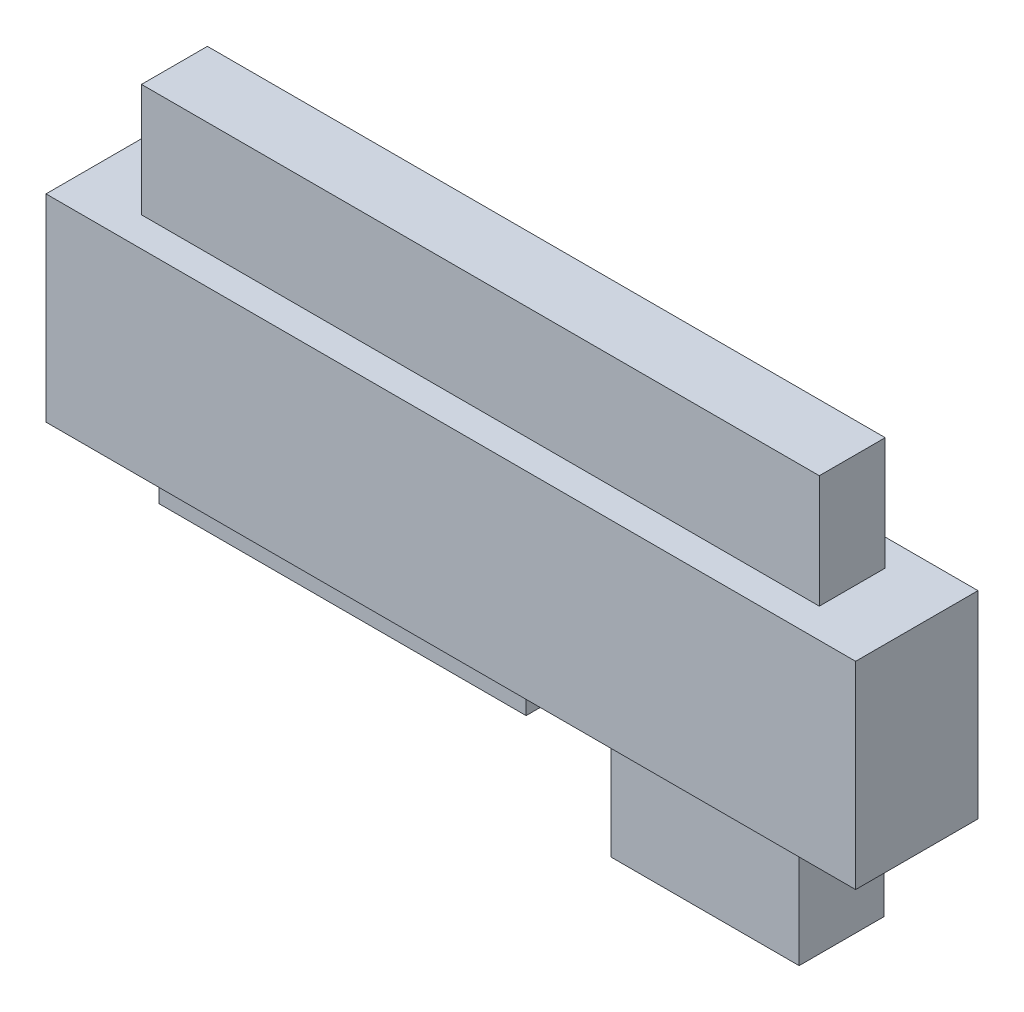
from build123d import *

# Parameters (mm, degrees)
SKETCH1_W           = 43
SKETCH1_H           = 6.5
BOSS_EXTRUDE1_DEPTH = 10.5
SKETCH2_W           = 36
SKETCH2_H           = 3.5
BOSS_EXTRUDE3_DEPTH = 6
SKETCH3_W           = 10
SKETCH3_H           = 4.5
BOSS_EXTRUDE4_DEPTH = 6
SKETCH4_W           = 19.5
SKETCH4_H           = 4
BOSS_EXTRUDE5_DEPTH = 2


with BuildPart() as part:
    # Sketch1 → Boss-Extrude1 (new body)
    with BuildSketch(Plane(origin=(0, 0, 0), x_dir=(1, 0, 0), z_dir=(0, 1, 0))):
        Rectangle(SKETCH1_W, SKETCH1_H)
    extrude(amount=BOSS_EXTRUDE1_DEPTH)

    # Sketch2 → Boss-Extrude3 (add)
    with BuildSketch(Plane(origin=(0, 10.5, 0), x_dir=(1, 0, 0), z_dir=(0, 1, 0))):
        with Locations((0, 0.072111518)):
            Rectangle(SKETCH2_W, SKETCH2_H)
    extrude(amount=BOSS_EXTRUDE3_DEPTH)

    # Sketch3 → Boss-Extrude4 (add)
    with BuildSketch(Plane.XZ):
        with Locations((12.5, 0)):
            Rectangle(SKETCH3_W, SKETCH3_H)
    extrude(amount=BOSS_EXTRUDE4_DEPTH)

    # Sketch4 → Boss-Extrude5 (add)
    with BuildSketch(Plane.XZ):
        with Locations((-7, 0)):
            Rectangle(SKETCH4_W, SKETCH4_H)
    extrude(amount=BOSS_EXTRUDE5_DEPTH)


solid = part.part
